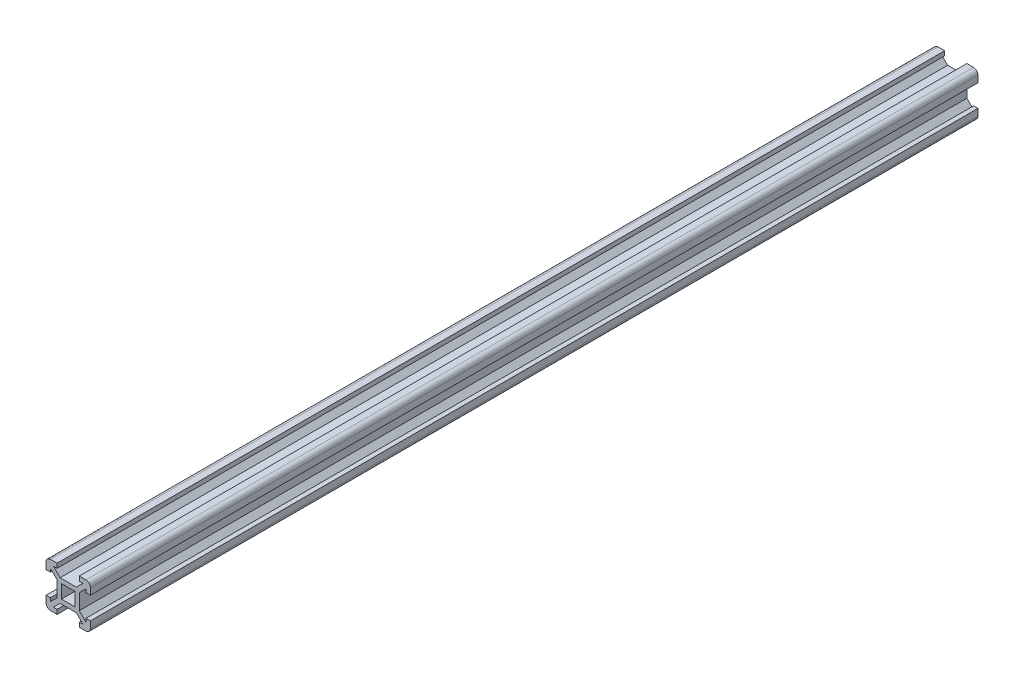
ISO-10303-21;
HEADER;
FILE_DESCRIPTION(('STEP AP214'),'2;1');
FILE_NAME('part.step','',(''),(''),'','','');
FILE_SCHEMA(('AUTOMOTIVE_DESIGN { 1 0 10303 214 1 1 1 1 }'));
ENDSEC;
DATA;
#1=APPLICATION_CONTEXT('core data for automotive mechanical design processes');
#2=APPLICATION_PROTOCOL_DEFINITION('international standard','automotive_design',2000,#1);
#3=PRODUCT_CONTEXT('',#1,'mechanical');
#4=PRODUCT('Part','Part','',(#3));
#5=PRODUCT_RELATED_PRODUCT_CATEGORY('part','',(#4));
#6=PRODUCT_DEFINITION_FORMATION('','',#4);
#7=PRODUCT_DEFINITION_CONTEXT('part definition',#1,'design');
#8=PRODUCT_DEFINITION('design','',#6,#7);
#9=PRODUCT_DEFINITION_SHAPE('','',#8);
#10=(LENGTH_UNIT() NAMED_UNIT(*) SI_UNIT(.MILLI.,.METRE.));
#11=(NAMED_UNIT(*) PLANE_ANGLE_UNIT() SI_UNIT($,.RADIAN.));
#12=(NAMED_UNIT(*) SI_UNIT($,.STERADIAN.) SOLID_ANGLE_UNIT());
#13=UNCERTAINTY_MEASURE_WITH_UNIT(LENGTH_MEASURE(1.E-05),#10,'distance_accuracy_value','');
#14=(GEOMETRIC_REPRESENTATION_CONTEXT(3) GLOBAL_UNCERTAINTY_ASSIGNED_CONTEXT((#13)) GLOBAL_UNIT_ASSIGNED_CONTEXT((#10,
#11,#12)) REPRESENTATION_CONTEXT('',''));
#15=CARTESIAN_POINT('',(0.,0.,0.));
#16=DIRECTION('',(0.,0.,1.));
#17=DIRECTION('',(1.,0.,0.));
#18=AXIS2_PLACEMENT_3D('',#15,#16,#17);
#19=CARTESIAN_POINT('',(2.00000000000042,18.0000000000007,400.));
#20=DIRECTION('',(0.,0.,-1.));
#21=DIRECTION('',(-1.,0.,0.));
#22=AXIS2_PLACEMENT_3D('',#19,#20,#21);
#23=PLANE('',#22);
#24=DIRECTION('',(0.712320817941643,-0.701854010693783,0.));
#25=VECTOR('',#24,1.);
#26=CARTESIAN_POINT('',(5.00000000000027,13.5226684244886,400.));
#27=LINE('',#26,#25);
#28=CARTESIAN_POINT('',(2.00000000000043,16.4785865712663,400.));
#29=VERTEX_POINT('',#28);
#30=CARTESIAN_POINT('',(5.00000000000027,13.5226684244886,400.));
#31=VERTEX_POINT('',#30);
#32=EDGE_CURVE('E348',#29,#31,#27,.T.);
#33=ORIENTED_EDGE('',*,*,#32,.T.);
#34=DIRECTION('',(0.,-1.,0.));
#35=VECTOR('',#34,1.);
#36=CARTESIAN_POINT('',(5.00000000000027,13.5226684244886,400.));
#37=LINE('',#36,#35);
#38=CARTESIAN_POINT('',(5.00000000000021,6.47733157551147,400.));
#39=VERTEX_POINT('',#38);
#40=EDGE_CURVE('E351',#31,#39,#37,.T.);
#41=ORIENTED_EDGE('',*,*,#40,.T.);
#42=DIRECTION('',(-0.712320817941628,-0.701854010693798,0.));
#43=VECTOR('',#42,1.);
#44=CARTESIAN_POINT('',(5.00000000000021,6.47733157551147,400.));
#45=LINE('',#44,#43);
#46=CARTESIAN_POINT('',(2.00000000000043,3.52141342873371,400.));
#47=VERTEX_POINT('',#46);
#48=EDGE_CURVE('E354',#39,#47,#45,.T.);
#49=ORIENTED_EDGE('',*,*,#48,.T.);
#50=DIRECTION('',(0.,1.,0.));
#51=VECTOR('',#50,1.);
#52=CARTESIAN_POINT('',(2.00000000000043,3.52141342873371,400.));
#53=LINE('',#52,#51);
#54=CARTESIAN_POINT('',(2.00000000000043,4.99999999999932,400.));
#55=VERTEX_POINT('',#54);
#56=EDGE_CURVE('E356',#47,#55,#53,.T.);
#57=ORIENTED_EDGE('',*,*,#56,.T.);
#58=DIRECTION('',(-1.,0.,0.));
#59=VECTOR('',#58,1.);
#60=CARTESIAN_POINT('',(4.24509251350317E-13,4.99999999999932,400.));
#61=LINE('',#60,#59);
#62=CARTESIAN_POINT('',(4.24509251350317E-13,4.99999999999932,400.));
#63=VERTEX_POINT('',#62);
#64=EDGE_CURVE('E358',#55,#63,#61,.T.);
#65=ORIENTED_EDGE('',*,*,#64,.T.);
#66=DIRECTION('',(0.,-1.,0.));
#67=VECTOR('',#66,1.);
#68=CARTESIAN_POINT('',(4.24509251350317E-13,4.99999999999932,400.));
#69=LINE('',#68,#67);
#70=CARTESIAN_POINT('',(4.24509251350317E-13,1.99999999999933,400.));
#71=VERTEX_POINT('',#70);
#72=EDGE_CURVE('E360',#63,#71,#69,.T.);
#73=ORIENTED_EDGE('',*,*,#72,.T.);
#74=CARTESIAN_POINT('',(2.00000000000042,1.99999999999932,400.));
#75=DIRECTION('',(0.,0.,1.));
#76=DIRECTION('',(1.,0.,0.));
#77=AXIS2_PLACEMENT_3D('',#74,#75,#76);
#78=CIRCLE('',#77,2.);
#79=CARTESIAN_POINT('',(2.00000000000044,-6.83481049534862E-13,400.));
#80=VERTEX_POINT('',#79);
#81=EDGE_CURVE('E362',#71,#80,#78,.T.);
#82=ORIENTED_EDGE('',*,*,#81,.T.);
#83=DIRECTION('',(1.,0.,0.));
#84=VECTOR('',#83,1.);
#85=CARTESIAN_POINT('',(2.00000000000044,-6.83481049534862E-13,400.));
#86=LINE('',#85,#84);
#87=CARTESIAN_POINT('',(5.,-6.83481049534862E-13,400.));
#88=VERTEX_POINT('',#87);
#89=EDGE_CURVE('E364',#80,#88,#86,.T.);
#90=ORIENTED_EDGE('',*,*,#89,.T.);
#91=DIRECTION('',(0.,1.,0.));
#92=VECTOR('',#91,1.);
#93=CARTESIAN_POINT('',(5.,-6.83481049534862E-13,400.));
#94=LINE('',#93,#92);
#95=CARTESIAN_POINT('',(5.,2.,400.));
#96=VERTEX_POINT('',#95);
#97=EDGE_CURVE('E366',#88,#96,#94,.T.);
#98=ORIENTED_EDGE('',*,*,#97,.T.);
#99=DIRECTION('',(-1.,0.,0.));
#100=VECTOR('',#99,1.);
#101=CARTESIAN_POINT('',(3.30549306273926,1.99999999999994,400.));
#102=LINE('',#101,#100);
#103=CARTESIAN_POINT('',(3.30549306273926,1.99999999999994,400.));
#104=VERTEX_POINT('',#103);
#105=EDGE_CURVE('E368',#96,#104,#102,.T.);
#106=ORIENTED_EDGE('',*,*,#105,.T.);
#107=DIRECTION('',(0.712320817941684,0.701854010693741,0.));
#108=VECTOR('',#107,1.);
#109=CARTESIAN_POINT('',(6.35023231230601,4.99999999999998,400.));
#110=LINE('',#109,#108);
#111=CARTESIAN_POINT('',(6.35023231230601,4.99999999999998,400.));
#112=VERTEX_POINT('',#111);
#113=EDGE_CURVE('E370',#104,#112,#110,.T.);
#114=ORIENTED_EDGE('',*,*,#113,.T.);
#115=DIRECTION('',(1.,0.,0.));
#116=VECTOR('',#115,1.);
#117=CARTESIAN_POINT('',(6.35023231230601,4.99999999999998,400.));
#118=LINE('',#117,#116);
#119=CARTESIAN_POINT('',(13.649767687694,4.99999999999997,400.));
#120=VERTEX_POINT('',#119);
#121=EDGE_CURVE('E372',#112,#120,#118,.T.);
#122=ORIENTED_EDGE('',*,*,#121,.T.);
#123=DIRECTION('',(0.712320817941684,-0.701854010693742,0.));
#124=VECTOR('',#123,1.);
#125=CARTESIAN_POINT('',(13.649767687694,4.99999999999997,400.));
#126=LINE('',#125,#124);
#127=CARTESIAN_POINT('',(16.6945069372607,1.99999999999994,400.));
#128=VERTEX_POINT('',#127);
#129=EDGE_CURVE('E374',#120,#128,#126,.T.);
#130=ORIENTED_EDGE('',*,*,#129,.T.);
#131=DIRECTION('',(-1.,0.,0.));
#132=VECTOR('',#131,1.);
#133=CARTESIAN_POINT('',(16.6945069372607,1.99999999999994,400.));
#134=LINE('',#133,#132);
#135=CARTESIAN_POINT('',(15.,2.,400.));
#136=VERTEX_POINT('',#135);
#137=EDGE_CURVE('E376',#128,#136,#134,.T.);
#138=ORIENTED_EDGE('',*,*,#137,.T.);
#139=DIRECTION('',(0.,-1.,0.));
#140=VECTOR('',#139,1.);
#141=CARTESIAN_POINT('',(15.,-6.83481049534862E-13,400.));
#142=LINE('',#141,#140);
#143=CARTESIAN_POINT('',(15.,-6.83481049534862E-13,400.));
#144=VERTEX_POINT('',#143);
#145=EDGE_CURVE('E378',#136,#144,#142,.T.);
#146=ORIENTED_EDGE('',*,*,#145,.T.);
#147=DIRECTION('',(1.,0.,0.));
#148=VECTOR('',#147,1.);
#149=CARTESIAN_POINT('',(17.9999999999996,-6.85562717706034E-13,400.));
#150=LINE('',#149,#148);
#151=CARTESIAN_POINT('',(17.9999999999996,-6.85562717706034E-13,400.));
#152=VERTEX_POINT('',#151);
#153=EDGE_CURVE('E380',#144,#152,#150,.T.);
#154=ORIENTED_EDGE('',*,*,#153,.T.);
#155=CARTESIAN_POINT('',(17.9999999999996,1.99999999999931,400.));
#156=DIRECTION('',(0.,0.,1.));
#157=DIRECTION('',(1.,0.,0.));
#158=AXIS2_PLACEMENT_3D('',#155,#156,#157);
#159=CIRCLE('',#158,2.);
#160=CARTESIAN_POINT('',(19.9999999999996,1.99999999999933,400.));
#161=VERTEX_POINT('',#160);
#162=EDGE_CURVE('E382',#152,#161,#159,.T.);
#163=ORIENTED_EDGE('',*,*,#162,.T.);
#164=DIRECTION('',(0.,1.,0.));
#165=VECTOR('',#164,1.);
#166=CARTESIAN_POINT('',(19.9999999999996,4.99999999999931,400.));
#167=LINE('',#166,#165);
#168=CARTESIAN_POINT('',(19.9999999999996,4.99999999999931,400.));
#169=VERTEX_POINT('',#168);
#170=EDGE_CURVE('E384',#161,#169,#167,.T.);
#171=ORIENTED_EDGE('',*,*,#170,.T.);
#172=DIRECTION('',(-1.,0.,0.));
#173=VECTOR('',#172,1.);
#174=CARTESIAN_POINT('',(19.9999999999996,4.99999999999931,400.));
#175=LINE('',#174,#173);
#176=CARTESIAN_POINT('',(17.9999999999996,4.99999999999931,400.));
#177=VERTEX_POINT('',#176);
#178=EDGE_CURVE('E386',#169,#177,#175,.T.);
#179=ORIENTED_EDGE('',*,*,#178,.T.);
#180=DIRECTION('',(0.,-1.,0.));
#181=VECTOR('',#180,1.);
#182=CARTESIAN_POINT('',(17.9999999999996,3.52141342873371,400.));
#183=LINE('',#182,#181);
#184=CARTESIAN_POINT('',(17.9999999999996,3.52141342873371,400.));
#185=VERTEX_POINT('',#184);
#186=EDGE_CURVE('E388',#177,#185,#183,.T.);
#187=ORIENTED_EDGE('',*,*,#186,.T.);
#188=DIRECTION('',(-0.712320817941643,0.701854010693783,0.));
#189=VECTOR('',#188,1.);
#190=CARTESIAN_POINT('',(14.9999999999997,6.47733157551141,400.));
#191=LINE('',#190,#189);
#192=CARTESIAN_POINT('',(14.9999999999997,6.47733157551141,400.));
#193=VERTEX_POINT('',#192);
#194=EDGE_CURVE('E390',#185,#193,#191,.T.);
#195=ORIENTED_EDGE('',*,*,#194,.T.);
#196=DIRECTION('',(0.,1.,0.));
#197=VECTOR('',#196,1.);
#198=CARTESIAN_POINT('',(14.9999999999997,13.5226684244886,400.));
#199=LINE('',#198,#197);
#200=CARTESIAN_POINT('',(14.9999999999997,13.5226684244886,400.));
#201=VERTEX_POINT('',#200);
#202=EDGE_CURVE('E392',#193,#201,#199,.T.);
#203=ORIENTED_EDGE('',*,*,#202,.T.);
#204=DIRECTION('',(0.712320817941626,0.7018540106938,0.));
#205=VECTOR('',#204,1.);
#206=CARTESIAN_POINT('',(14.9999999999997,13.5226684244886,400.));
#207=LINE('',#206,#205);
#208=CARTESIAN_POINT('',(17.9999999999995,16.4785865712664,400.));
#209=VERTEX_POINT('',#208);
#210=EDGE_CURVE('E394',#201,#209,#207,.T.);
#211=ORIENTED_EDGE('',*,*,#210,.T.);
#212=DIRECTION('',(0.,-1.,0.));
#213=VECTOR('',#212,1.);
#214=CARTESIAN_POINT('',(17.9999999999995,16.4785865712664,400.));
#215=LINE('',#214,#213);
#216=CARTESIAN_POINT('',(17.9999999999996,15.0000000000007,400.));
#217=VERTEX_POINT('',#216);
#218=EDGE_CURVE('E396',#209,#217,#215,.T.);
#219=ORIENTED_EDGE('',*,*,#218,.T.);
#220=DIRECTION('',(1.,0.,0.));
#221=VECTOR('',#220,1.);
#222=CARTESIAN_POINT('',(19.9999999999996,15.0000000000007,400.));
#223=LINE('',#222,#221);
#224=CARTESIAN_POINT('',(19.9999999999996,15.0000000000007,400.));
#225=VERTEX_POINT('',#224);
#226=EDGE_CURVE('E398',#217,#225,#223,.T.);
#227=ORIENTED_EDGE('',*,*,#226,.T.);
#228=DIRECTION('',(0.,1.,0.));
#229=VECTOR('',#228,1.);
#230=CARTESIAN_POINT('',(19.9999999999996,15.0000000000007,400.));
#231=LINE('',#230,#229);
#232=CARTESIAN_POINT('',(19.9999999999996,18.0000000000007,400.));
#233=VERTEX_POINT('',#232);
#234=EDGE_CURVE('E400',#225,#233,#231,.T.);
#235=ORIENTED_EDGE('',*,*,#234,.T.);
#236=CARTESIAN_POINT('',(17.9999999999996,18.0000000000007,400.));
#237=DIRECTION('',(0.,0.,1.));
#238=DIRECTION('',(1.,0.,0.));
#239=AXIS2_PLACEMENT_3D('',#236,#237,#238);
#240=CIRCLE('',#239,2.);
#241=CARTESIAN_POINT('',(17.9999999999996,20.0000000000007,400.));
#242=VERTEX_POINT('',#241);
#243=EDGE_CURVE('E402',#233,#242,#240,.T.);
#244=ORIENTED_EDGE('',*,*,#243,.T.);
#245=DIRECTION('',(-1.,0.,0.));
#246=VECTOR('',#245,1.);
#247=CARTESIAN_POINT('',(17.9999999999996,20.0000000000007,400.));
#248=LINE('',#247,#246);
#249=CARTESIAN_POINT('',(15.,20.0000000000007,400.));
#250=VERTEX_POINT('',#249);
#251=EDGE_CURVE('E404',#242,#250,#248,.T.);
#252=ORIENTED_EDGE('',*,*,#251,.T.);
#253=DIRECTION('',(0.,-1.,0.));
#254=VECTOR('',#253,1.);
#255=CARTESIAN_POINT('',(15.,20.0000000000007,400.));
#256=LINE('',#255,#254);
#257=CARTESIAN_POINT('',(15.,18.,400.));
#258=VERTEX_POINT('',#257);
#259=EDGE_CURVE('E406',#250,#258,#256,.T.);
#260=ORIENTED_EDGE('',*,*,#259,.T.);
#261=DIRECTION('',(1.,0.,0.));
#262=VECTOR('',#261,1.);
#263=CARTESIAN_POINT('',(16.6945069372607,18.0000000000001,400.));
#264=LINE('',#263,#262);
#265=CARTESIAN_POINT('',(16.6945069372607,18.0000000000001,400.));
#266=VERTEX_POINT('',#265);
#267=EDGE_CURVE('E408',#258,#266,#264,.T.);
#268=ORIENTED_EDGE('',*,*,#267,.T.);
#269=DIRECTION('',(-0.712320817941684,-0.701854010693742,0.));
#270=VECTOR('',#269,1.);
#271=CARTESIAN_POINT('',(13.649767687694,15.,400.));
#272=LINE('',#271,#270);
#273=CARTESIAN_POINT('',(13.649767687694,15.,400.));
#274=VERTEX_POINT('',#273);
#275=EDGE_CURVE('E410',#266,#274,#272,.T.);
#276=ORIENTED_EDGE('',*,*,#275,.T.);
#277=DIRECTION('',(-1.,0.,0.));
#278=VECTOR('',#277,1.);
#279=CARTESIAN_POINT('',(6.35023231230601,15.,400.));
#280=LINE('',#279,#278);
#281=CARTESIAN_POINT('',(6.35023231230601,15.,400.));
#282=VERTEX_POINT('',#281);
#283=EDGE_CURVE('E412',#274,#282,#280,.T.);
#284=ORIENTED_EDGE('',*,*,#283,.T.);
#285=DIRECTION('',(-0.712320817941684,0.701854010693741,0.));
#286=VECTOR('',#285,1.);
#287=CARTESIAN_POINT('',(6.35023231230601,15.,400.));
#288=LINE('',#287,#286);
#289=CARTESIAN_POINT('',(3.30549306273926,18.0000000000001,400.));
#290=VERTEX_POINT('',#289);
#291=EDGE_CURVE('E414',#282,#290,#288,.T.);
#292=ORIENTED_EDGE('',*,*,#291,.T.);
#293=DIRECTION('',(1.,0.,0.));
#294=VECTOR('',#293,1.);
#295=CARTESIAN_POINT('',(3.30549306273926,18.0000000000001,400.));
#296=LINE('',#295,#294);
#297=CARTESIAN_POINT('',(5.,18.,400.));
#298=VERTEX_POINT('',#297);
#299=EDGE_CURVE('E416',#290,#298,#296,.T.);
#300=ORIENTED_EDGE('',*,*,#299,.T.);
#301=DIRECTION('',(0.,1.,0.));
#302=VECTOR('',#301,1.);
#303=CARTESIAN_POINT('',(5.,20.0000000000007,400.));
#304=LINE('',#303,#302);
#305=CARTESIAN_POINT('',(5.,20.0000000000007,400.));
#306=VERTEX_POINT('',#305);
#307=EDGE_CURVE('E418',#298,#306,#304,.T.);
#308=ORIENTED_EDGE('',*,*,#307,.T.);
#309=DIRECTION('',(-1.,0.,0.));
#310=VECTOR('',#309,1.);
#311=CARTESIAN_POINT('',(2.00000000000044,20.0000000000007,400.));
#312=LINE('',#311,#310);
#313=CARTESIAN_POINT('',(2.00000000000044,20.0000000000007,400.));
#314=VERTEX_POINT('',#313);
#315=EDGE_CURVE('E420',#306,#314,#312,.T.);
#316=ORIENTED_EDGE('',*,*,#315,.T.);
#317=CARTESIAN_POINT('',(2.00000000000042,18.0000000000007,400.));
#318=DIRECTION('',(0.,0.,1.));
#319=DIRECTION('',(-1.,0.,0.));
#320=AXIS2_PLACEMENT_3D('',#317,#318,#319);
#321=CIRCLE('',#320,2.);
#322=CARTESIAN_POINT('',(4.25007251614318E-13,18.0000000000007,400.));
#323=VERTEX_POINT('',#322);
#324=EDGE_CURVE('E422',#314,#323,#321,.T.);
#325=ORIENTED_EDGE('',*,*,#324,.T.);
#326=DIRECTION('',(0.,-1.,0.));
#327=VECTOR('',#326,1.);
#328=CARTESIAN_POINT('',(4.24509251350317E-13,15.0000000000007,400.));
#329=LINE('',#328,#327);
#330=CARTESIAN_POINT('',(4.24509251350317E-13,15.0000000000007,400.));
#331=VERTEX_POINT('',#330);
#332=EDGE_CURVE('E424',#323,#331,#329,.T.);
#333=ORIENTED_EDGE('',*,*,#332,.T.);
#334=DIRECTION('',(1.,0.,0.));
#335=VECTOR('',#334,1.);
#336=CARTESIAN_POINT('',(4.24509251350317E-13,15.0000000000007,400.));
#337=LINE('',#336,#335);
#338=CARTESIAN_POINT('',(2.00000000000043,15.0000000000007,400.));
#339=VERTEX_POINT('',#338);
#340=EDGE_CURVE('E426',#331,#339,#337,.T.);
#341=ORIENTED_EDGE('',*,*,#340,.T.);
#342=DIRECTION('',(0.,1.,0.));
#343=VECTOR('',#342,1.);
#344=CARTESIAN_POINT('',(2.00000000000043,16.4785865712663,400.));
#345=LINE('',#344,#343);
#346=EDGE_CURVE('E428',#339,#29,#345,.T.);
#347=ORIENTED_EDGE('',*,*,#346,.T.);
#348=EDGE_LOOP('',(#33,#41,#49,#57,#65,#73,#82,#90,#98,#106,#114,#122,#130,#138,#146,#154,#163,
#171,#179,#187,#195,#203,#211,#219,#227,#235,#244,#252,#260,#268,#276,#284,#292,#300,#308,#316,
#325,#333,#341,#347));
#349=FACE_BOUND('',#348,.T.);
#350=DIRECTION('',(0.,1.,0.));
#351=VECTOR('',#350,1.);
#352=CARTESIAN_POINT('',(13.0427076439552,13.0427076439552,400.));
#353=LINE('',#352,#351);
#354=CARTESIAN_POINT('',(13.0427076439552,6.9572923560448,400.));
#355=VERTEX_POINT('',#354);
#356=CARTESIAN_POINT('',(13.0427076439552,13.0427076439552,400.));
#357=VERTEX_POINT('',#356);
#358=EDGE_CURVE('E312',#355,#357,#353,.T.);
#359=ORIENTED_EDGE('',*,*,#358,.F.);
#360=DIRECTION('',(1.,0.,0.));
#361=VECTOR('',#360,1.);
#362=CARTESIAN_POINT('',(6.95729235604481,6.9572923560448,400.));
#363=LINE('',#362,#361);
#364=CARTESIAN_POINT('',(6.95729235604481,6.9572923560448,400.));
#365=VERTEX_POINT('',#364);
#366=EDGE_CURVE('E334',#365,#355,#363,.T.);
#367=ORIENTED_EDGE('',*,*,#366,.F.);
#368=DIRECTION('',(0.,-1.,0.));
#369=VECTOR('',#368,1.);
#370=CARTESIAN_POINT('',(6.95729235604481,13.0427076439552,400.));
#371=LINE('',#370,#369);
#372=CARTESIAN_POINT('',(6.95729235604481,13.0427076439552,400.));
#373=VERTEX_POINT('',#372);
#374=EDGE_CURVE('E332',#373,#365,#371,.T.);
#375=ORIENTED_EDGE('',*,*,#374,.F.);
#376=DIRECTION('',(-1.,0.,0.));
#377=VECTOR('',#376,1.);
#378=CARTESIAN_POINT('',(6.95729235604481,13.0427076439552,400.));
#379=LINE('',#378,#377);
#380=EDGE_CURVE('E320',#357,#373,#379,.T.);
#381=ORIENTED_EDGE('',*,*,#380,.F.);
#382=EDGE_LOOP('',(#359,#367,#375,#381));
#383=FACE_BOUND('',#382,.T.);
#384=ADVANCED_FACE('F31',(#349,#383),#23,.F.);
#385=CARTESIAN_POINT('',(2.00000000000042,18.0000000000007,0.));
#386=DIRECTION('',(0.,0.,-1.));
#387=DIRECTION('',(-1.,0.,0.));
#388=AXIS2_PLACEMENT_3D('',#385,#386,#387);
#389=PLANE('',#388);
#390=DIRECTION('',(0.712320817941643,-0.701854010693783,0.));
#391=VECTOR('',#390,1.);
#392=CARTESIAN_POINT('',(5.00000000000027,13.5226684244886,0.));
#393=LINE('',#392,#391);
#394=CARTESIAN_POINT('',(2.00000000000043,16.4785865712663,0.));
#395=VERTEX_POINT('',#394);
#396=CARTESIAN_POINT('',(5.00000000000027,13.5226684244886,0.));
#397=VERTEX_POINT('',#396);
#398=EDGE_CURVE('E328',#395,#397,#393,.T.);
#399=ORIENTED_EDGE('',*,*,#398,.F.);
#400=DIRECTION('',(0.,1.,0.));
#401=VECTOR('',#400,1.);
#402=CARTESIAN_POINT('',(2.00000000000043,16.4785865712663,0.));
#403=LINE('',#402,#401);
#404=CARTESIAN_POINT('',(2.00000000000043,15.0000000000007,0.));
#405=VERTEX_POINT('',#404);
#406=EDGE_CURVE('E352',#405,#395,#403,.T.);
#407=ORIENTED_EDGE('',*,*,#406,.F.);
#408=DIRECTION('',(1.,0.,0.));
#409=VECTOR('',#408,1.);
#410=CARTESIAN_POINT('',(4.24509251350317E-13,15.0000000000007,0.));
#411=LINE('',#410,#409);
#412=CARTESIAN_POINT('',(4.24509251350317E-13,15.0000000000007,0.));
#413=VERTEX_POINT('',#412);
#414=EDGE_CURVE('E507',#413,#405,#411,.T.);
#415=ORIENTED_EDGE('',*,*,#414,.F.);
#416=DIRECTION('',(0.,-1.,0.));
#417=VECTOR('',#416,1.);
#418=CARTESIAN_POINT('',(4.24509251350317E-13,15.0000000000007,0.));
#419=LINE('',#418,#417);
#420=CARTESIAN_POINT('',(4.25007251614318E-13,18.0000000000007,0.));
#421=VERTEX_POINT('',#420);
#422=EDGE_CURVE('E505',#421,#413,#419,.T.);
#423=ORIENTED_EDGE('',*,*,#422,.F.);
#424=CARTESIAN_POINT('',(2.00000000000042,18.0000000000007,0.));
#425=DIRECTION('',(0.,0.,1.));
#426=DIRECTION('',(-1.,0.,0.));
#427=AXIS2_PLACEMENT_3D('',#424,#425,#426);
#428=CIRCLE('',#427,2.);
#429=CARTESIAN_POINT('',(2.00000000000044,20.0000000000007,0.));
#430=VERTEX_POINT('',#429);
#431=EDGE_CURVE('E503',#430,#421,#428,.T.);
#432=ORIENTED_EDGE('',*,*,#431,.F.);
#433=DIRECTION('',(-1.,0.,0.));
#434=VECTOR('',#433,1.);
#435=CARTESIAN_POINT('',(2.00000000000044,20.0000000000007,0.));
#436=LINE('',#435,#434);
#437=CARTESIAN_POINT('',(5.,20.0000000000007,0.));
#438=VERTEX_POINT('',#437);
#439=EDGE_CURVE('E501',#438,#430,#436,.T.);
#440=ORIENTED_EDGE('',*,*,#439,.F.);
#441=DIRECTION('',(0.,1.,0.));
#442=VECTOR('',#441,1.);
#443=CARTESIAN_POINT('',(5.,20.0000000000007,0.));
#444=LINE('',#443,#442);
#445=CARTESIAN_POINT('',(5.,18.,0.));
#446=VERTEX_POINT('',#445);
#447=EDGE_CURVE('E499',#446,#438,#444,.T.);
#448=ORIENTED_EDGE('',*,*,#447,.F.);
#449=DIRECTION('',(1.,0.,0.));
#450=VECTOR('',#449,1.);
#451=CARTESIAN_POINT('',(3.30549306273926,18.0000000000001,0.));
#452=LINE('',#451,#450);
#453=CARTESIAN_POINT('',(3.30549306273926,18.0000000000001,0.));
#454=VERTEX_POINT('',#453);
#455=EDGE_CURVE('E497',#454,#446,#452,.T.);
#456=ORIENTED_EDGE('',*,*,#455,.F.);
#457=DIRECTION('',(-0.712320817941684,0.701854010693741,0.));
#458=VECTOR('',#457,1.);
#459=CARTESIAN_POINT('',(6.35023231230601,15.,0.));
#460=LINE('',#459,#458);
#461=CARTESIAN_POINT('',(6.35023231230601,15.,0.));
#462=VERTEX_POINT('',#461);
#463=EDGE_CURVE('E495',#462,#454,#460,.T.);
#464=ORIENTED_EDGE('',*,*,#463,.F.);
#465=DIRECTION('',(-1.,0.,0.));
#466=VECTOR('',#465,1.);
#467=CARTESIAN_POINT('',(6.35023231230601,15.,0.));
#468=LINE('',#467,#466);
#469=CARTESIAN_POINT('',(13.649767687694,15.,0.));
#470=VERTEX_POINT('',#469);
#471=EDGE_CURVE('E493',#470,#462,#468,.T.);
#472=ORIENTED_EDGE('',*,*,#471,.F.);
#473=DIRECTION('',(-0.712320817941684,-0.701854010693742,0.));
#474=VECTOR('',#473,1.);
#475=CARTESIAN_POINT('',(13.649767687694,15.,0.));
#476=LINE('',#475,#474);
#477=CARTESIAN_POINT('',(16.6945069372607,18.0000000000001,0.));
#478=VERTEX_POINT('',#477);
#479=EDGE_CURVE('E491',#478,#470,#476,.T.);
#480=ORIENTED_EDGE('',*,*,#479,.F.);
#481=DIRECTION('',(1.,0.,0.));
#482=VECTOR('',#481,1.);
#483=CARTESIAN_POINT('',(16.6945069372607,18.0000000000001,0.));
#484=LINE('',#483,#482);
#485=CARTESIAN_POINT('',(15.,18.,0.));
#486=VERTEX_POINT('',#485);
#487=EDGE_CURVE('E489',#486,#478,#484,.T.);
#488=ORIENTED_EDGE('',*,*,#487,.F.);
#489=DIRECTION('',(0.,-1.,0.));
#490=VECTOR('',#489,1.);
#491=CARTESIAN_POINT('',(15.,20.0000000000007,0.));
#492=LINE('',#491,#490);
#493=CARTESIAN_POINT('',(15.,20.0000000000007,0.));
#494=VERTEX_POINT('',#493);
#495=EDGE_CURVE('E487',#494,#486,#492,.T.);
#496=ORIENTED_EDGE('',*,*,#495,.F.);
#497=DIRECTION('',(-1.,0.,0.));
#498=VECTOR('',#497,1.);
#499=CARTESIAN_POINT('',(17.9999999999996,20.0000000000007,0.));
#500=LINE('',#499,#498);
#501=CARTESIAN_POINT('',(17.9999999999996,20.0000000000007,0.));
#502=VERTEX_POINT('',#501);
#503=EDGE_CURVE('E485',#502,#494,#500,.T.);
#504=ORIENTED_EDGE('',*,*,#503,.F.);
#505=CARTESIAN_POINT('',(17.9999999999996,18.0000000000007,0.));
#506=DIRECTION('',(0.,0.,1.));
#507=DIRECTION('',(1.,0.,0.));
#508=AXIS2_PLACEMENT_3D('',#505,#506,#507);
#509=CIRCLE('',#508,2.);
#510=CARTESIAN_POINT('',(19.9999999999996,18.0000000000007,0.));
#511=VERTEX_POINT('',#510);
#512=EDGE_CURVE('E483',#511,#502,#509,.T.);
#513=ORIENTED_EDGE('',*,*,#512,.F.);
#514=DIRECTION('',(0.,1.,0.));
#515=VECTOR('',#514,1.);
#516=CARTESIAN_POINT('',(19.9999999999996,15.0000000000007,0.));
#517=LINE('',#516,#515);
#518=CARTESIAN_POINT('',(19.9999999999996,15.0000000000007,0.));
#519=VERTEX_POINT('',#518);
#520=EDGE_CURVE('E481',#519,#511,#517,.T.);
#521=ORIENTED_EDGE('',*,*,#520,.F.);
#522=DIRECTION('',(1.,0.,0.));
#523=VECTOR('',#522,1.);
#524=CARTESIAN_POINT('',(19.9999999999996,15.0000000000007,0.));
#525=LINE('',#524,#523);
#526=CARTESIAN_POINT('',(17.9999999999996,15.0000000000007,0.));
#527=VERTEX_POINT('',#526);
#528=EDGE_CURVE('E479',#527,#519,#525,.T.);
#529=ORIENTED_EDGE('',*,*,#528,.F.);
#530=DIRECTION('',(0.,-1.,0.));
#531=VECTOR('',#530,1.);
#532=CARTESIAN_POINT('',(17.9999999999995,16.4785865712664,0.));
#533=LINE('',#532,#531);
#534=CARTESIAN_POINT('',(17.9999999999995,16.4785865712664,0.));
#535=VERTEX_POINT('',#534);
#536=EDGE_CURVE('E477',#535,#527,#533,.T.);
#537=ORIENTED_EDGE('',*,*,#536,.F.);
#538=DIRECTION('',(0.712320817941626,0.7018540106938,0.));
#539=VECTOR('',#538,1.);
#540=CARTESIAN_POINT('',(14.9999999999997,13.5226684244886,0.));
#541=LINE('',#540,#539);
#542=CARTESIAN_POINT('',(14.9999999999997,13.5226684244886,0.));
#543=VERTEX_POINT('',#542);
#544=EDGE_CURVE('E475',#543,#535,#541,.T.);
#545=ORIENTED_EDGE('',*,*,#544,.F.);
#546=DIRECTION('',(0.,1.,0.));
#547=VECTOR('',#546,1.);
#548=CARTESIAN_POINT('',(14.9999999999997,13.5226684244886,0.));
#549=LINE('',#548,#547);
#550=CARTESIAN_POINT('',(14.9999999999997,6.47733157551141,0.));
#551=VERTEX_POINT('',#550);
#552=EDGE_CURVE('E473',#551,#543,#549,.T.);
#553=ORIENTED_EDGE('',*,*,#552,.F.);
#554=DIRECTION('',(-0.712320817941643,0.701854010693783,0.));
#555=VECTOR('',#554,1.);
#556=CARTESIAN_POINT('',(14.9999999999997,6.47733157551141,0.));
#557=LINE('',#556,#555);
#558=CARTESIAN_POINT('',(17.9999999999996,3.52141342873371,0.));
#559=VERTEX_POINT('',#558);
#560=EDGE_CURVE('E471',#559,#551,#557,.T.);
#561=ORIENTED_EDGE('',*,*,#560,.F.);
#562=DIRECTION('',(0.,-1.,0.));
#563=VECTOR('',#562,1.);
#564=CARTESIAN_POINT('',(17.9999999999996,3.52141342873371,0.));
#565=LINE('',#564,#563);
#566=CARTESIAN_POINT('',(17.9999999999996,4.99999999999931,0.));
#567=VERTEX_POINT('',#566);
#568=EDGE_CURVE('E469',#567,#559,#565,.T.);
#569=ORIENTED_EDGE('',*,*,#568,.F.);
#570=DIRECTION('',(-1.,0.,0.));
#571=VECTOR('',#570,1.);
#572=CARTESIAN_POINT('',(19.9999999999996,4.99999999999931,0.));
#573=LINE('',#572,#571);
#574=CARTESIAN_POINT('',(19.9999999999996,4.99999999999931,0.));
#575=VERTEX_POINT('',#574);
#576=EDGE_CURVE('E467',#575,#567,#573,.T.);
#577=ORIENTED_EDGE('',*,*,#576,.F.);
#578=DIRECTION('',(0.,1.,0.));
#579=VECTOR('',#578,1.);
#580=CARTESIAN_POINT('',(19.9999999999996,4.99999999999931,0.));
#581=LINE('',#580,#579);
#582=CARTESIAN_POINT('',(19.9999999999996,1.99999999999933,0.));
#583=VERTEX_POINT('',#582);
#584=EDGE_CURVE('E465',#583,#575,#581,.T.);
#585=ORIENTED_EDGE('',*,*,#584,.F.);
#586=CARTESIAN_POINT('',(17.9999999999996,1.99999999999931,0.));
#587=DIRECTION('',(0.,0.,1.));
#588=DIRECTION('',(1.,0.,0.));
#589=AXIS2_PLACEMENT_3D('',#586,#587,#588);
#590=CIRCLE('',#589,2.);
#591=CARTESIAN_POINT('',(17.9999999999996,-6.85562717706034E-13,0.));
#592=VERTEX_POINT('',#591);
#593=EDGE_CURVE('E463',#592,#583,#590,.T.);
#594=ORIENTED_EDGE('',*,*,#593,.F.);
#595=DIRECTION('',(1.,0.,0.));
#596=VECTOR('',#595,1.);
#597=CARTESIAN_POINT('',(17.9999999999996,-6.85562717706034E-13,0.));
#598=LINE('',#597,#596);
#599=CARTESIAN_POINT('',(15.,-6.83481049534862E-13,0.));
#600=VERTEX_POINT('',#599);
#601=EDGE_CURVE('E461',#600,#592,#598,.T.);
#602=ORIENTED_EDGE('',*,*,#601,.F.);
#603=DIRECTION('',(0.,-1.,0.));
#604=VECTOR('',#603,1.);
#605=CARTESIAN_POINT('',(15.,-6.83481049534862E-13,0.));
#606=LINE('',#605,#604);
#607=CARTESIAN_POINT('',(15.,2.,0.));
#608=VERTEX_POINT('',#607);
#609=EDGE_CURVE('E459',#608,#600,#606,.T.);
#610=ORIENTED_EDGE('',*,*,#609,.F.);
#611=DIRECTION('',(-1.,0.,0.));
#612=VECTOR('',#611,1.);
#613=CARTESIAN_POINT('',(16.6945069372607,1.99999999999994,0.));
#614=LINE('',#613,#612);
#615=CARTESIAN_POINT('',(16.6945069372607,1.99999999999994,0.));
#616=VERTEX_POINT('',#615);
#617=EDGE_CURVE('E457',#616,#608,#614,.T.);
#618=ORIENTED_EDGE('',*,*,#617,.F.);
#619=DIRECTION('',(0.712320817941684,-0.701854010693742,0.));
#620=VECTOR('',#619,1.);
#621=CARTESIAN_POINT('',(13.649767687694,4.99999999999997,0.));
#622=LINE('',#621,#620);
#623=CARTESIAN_POINT('',(13.649767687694,4.99999999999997,0.));
#624=VERTEX_POINT('',#623);
#625=EDGE_CURVE('E455',#624,#616,#622,.T.);
#626=ORIENTED_EDGE('',*,*,#625,.F.);
#627=DIRECTION('',(1.,0.,0.));
#628=VECTOR('',#627,1.);
#629=CARTESIAN_POINT('',(6.35023231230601,4.99999999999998,0.));
#630=LINE('',#629,#628);
#631=CARTESIAN_POINT('',(6.35023231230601,4.99999999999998,0.));
#632=VERTEX_POINT('',#631);
#633=EDGE_CURVE('E453',#632,#624,#630,.T.);
#634=ORIENTED_EDGE('',*,*,#633,.F.);
#635=DIRECTION('',(0.712320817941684,0.701854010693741,0.));
#636=VECTOR('',#635,1.);
#637=CARTESIAN_POINT('',(6.35023231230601,4.99999999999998,0.));
#638=LINE('',#637,#636);
#639=CARTESIAN_POINT('',(3.30549306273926,1.99999999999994,0.));
#640=VERTEX_POINT('',#639);
#641=EDGE_CURVE('E451',#640,#632,#638,.T.);
#642=ORIENTED_EDGE('',*,*,#641,.F.);
#643=DIRECTION('',(-1.,0.,0.));
#644=VECTOR('',#643,1.);
#645=CARTESIAN_POINT('',(3.30549306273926,1.99999999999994,0.));
#646=LINE('',#645,#644);
#647=CARTESIAN_POINT('',(5.,2.,0.));
#648=VERTEX_POINT('',#647);
#649=EDGE_CURVE('E449',#648,#640,#646,.T.);
#650=ORIENTED_EDGE('',*,*,#649,.F.);
#651=DIRECTION('',(0.,1.,0.));
#652=VECTOR('',#651,1.);
#653=CARTESIAN_POINT('',(5.,-6.83481049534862E-13,0.));
#654=LINE('',#653,#652);
#655=CARTESIAN_POINT('',(5.,-6.83481049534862E-13,0.));
#656=VERTEX_POINT('',#655);
#657=EDGE_CURVE('E447',#656,#648,#654,.T.);
#658=ORIENTED_EDGE('',*,*,#657,.F.);
#659=DIRECTION('',(1.,0.,0.));
#660=VECTOR('',#659,1.);
#661=CARTESIAN_POINT('',(2.00000000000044,-6.83481049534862E-13,0.));
#662=LINE('',#661,#660);
#663=CARTESIAN_POINT('',(2.00000000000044,-6.83481049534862E-13,0.));
#664=VERTEX_POINT('',#663);
#665=EDGE_CURVE('E445',#664,#656,#662,.T.);
#666=ORIENTED_EDGE('',*,*,#665,.F.);
#667=CARTESIAN_POINT('',(2.00000000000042,1.99999999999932,0.));
#668=DIRECTION('',(0.,0.,1.));
#669=DIRECTION('',(1.,0.,0.));
#670=AXIS2_PLACEMENT_3D('',#667,#668,#669);
#671=CIRCLE('',#670,2.);
#672=CARTESIAN_POINT('',(4.24509251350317E-13,1.99999999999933,0.));
#673=VERTEX_POINT('',#672);
#674=EDGE_CURVE('E443',#673,#664,#671,.T.);
#675=ORIENTED_EDGE('',*,*,#674,.F.);
#676=DIRECTION('',(0.,-1.,0.));
#677=VECTOR('',#676,1.);
#678=CARTESIAN_POINT('',(4.24509251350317E-13,4.99999999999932,0.));
#679=LINE('',#678,#677);
#680=CARTESIAN_POINT('',(4.24509251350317E-13,4.99999999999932,0.));
#681=VERTEX_POINT('',#680);
#682=EDGE_CURVE('E441',#681,#673,#679,.T.);
#683=ORIENTED_EDGE('',*,*,#682,.F.);
#684=DIRECTION('',(-1.,0.,0.));
#685=VECTOR('',#684,1.);
#686=CARTESIAN_POINT('',(4.24509251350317E-13,4.99999999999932,0.));
#687=LINE('',#686,#685);
#688=CARTESIAN_POINT('',(2.00000000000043,4.99999999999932,0.));
#689=VERTEX_POINT('',#688);
#690=EDGE_CURVE('E439',#689,#681,#687,.T.);
#691=ORIENTED_EDGE('',*,*,#690,.F.);
#692=DIRECTION('',(0.,1.,0.));
#693=VECTOR('',#692,1.);
#694=CARTESIAN_POINT('',(2.00000000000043,3.52141342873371,0.));
#695=LINE('',#694,#693);
#696=CARTESIAN_POINT('',(2.00000000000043,3.52141342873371,0.));
#697=VERTEX_POINT('',#696);
#698=EDGE_CURVE('E437',#697,#689,#695,.T.);
#699=ORIENTED_EDGE('',*,*,#698,.F.);
#700=DIRECTION('',(-0.712320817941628,-0.701854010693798,0.));
#701=VECTOR('',#700,1.);
#702=CARTESIAN_POINT('',(5.00000000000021,6.47733157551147,0.));
#703=LINE('',#702,#701);
#704=CARTESIAN_POINT('',(5.00000000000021,6.47733157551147,0.));
#705=VERTEX_POINT('',#704);
#706=EDGE_CURVE('E435',#705,#697,#703,.T.);
#707=ORIENTED_EDGE('',*,*,#706,.F.);
#708=DIRECTION('',(0.,-1.,0.));
#709=VECTOR('',#708,1.);
#710=CARTESIAN_POINT('',(5.00000000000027,13.5226684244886,0.));
#711=LINE('',#710,#709);
#712=EDGE_CURVE('E433',#397,#705,#711,.T.);
#713=ORIENTED_EDGE('',*,*,#712,.F.);
#714=EDGE_LOOP('',(#399,#407,#415,#423,#432,#440,#448,#456,#464,#472,#480,#488,#496,#504,#513,
#521,#529,#537,#545,#553,#561,#569,#577,#585,#594,#602,#610,#618,#626,#634,#642,#650,#658,#666,
#675,#683,#691,#699,#707,#713));
#715=FACE_BOUND('',#714,.T.);
#716=DIRECTION('',(1.,0.,0.));
#717=VECTOR('',#716,1.);
#718=CARTESIAN_POINT('',(6.95729235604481,6.9572923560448,0.));
#719=LINE('',#718,#717);
#720=CARTESIAN_POINT('',(6.95729235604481,6.9572923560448,0.));
#721=VERTEX_POINT('',#720);
#722=CARTESIAN_POINT('',(13.0427076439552,6.9572923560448,0.));
#723=VERTEX_POINT('',#722);
#724=EDGE_CURVE('E321',#721,#723,#719,.T.);
#725=ORIENTED_EDGE('',*,*,#724,.T.);
#726=DIRECTION('',(0.,1.,0.));
#727=VECTOR('',#726,1.);
#728=CARTESIAN_POINT('',(13.0427076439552,13.0427076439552,0.));
#729=LINE('',#728,#727);
#730=CARTESIAN_POINT('',(13.0427076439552,13.0427076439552,0.));
#731=VERTEX_POINT('',#730);
#732=EDGE_CURVE('E54',#723,#731,#729,.T.);
#733=ORIENTED_EDGE('',*,*,#732,.T.);
#734=DIRECTION('',(-1.,0.,0.));
#735=VECTOR('',#734,1.);
#736=CARTESIAN_POINT('',(6.95729235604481,13.0427076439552,0.));
#737=LINE('',#736,#735);
#738=CARTESIAN_POINT('',(6.95729235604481,13.0427076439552,0.));
#739=VERTEX_POINT('',#738);
#740=EDGE_CURVE('E327',#731,#739,#737,.T.);
#741=ORIENTED_EDGE('',*,*,#740,.T.);
#742=DIRECTION('',(0.,-1.,0.));
#743=VECTOR('',#742,1.);
#744=CARTESIAN_POINT('',(6.95729235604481,13.0427076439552,0.));
#745=LINE('',#744,#743);
#746=EDGE_CURVE('E340',#739,#721,#745,.T.);
#747=ORIENTED_EDGE('',*,*,#746,.T.);
#748=EDGE_LOOP('',(#725,#733,#741,#747));
#749=FACE_BOUND('',#748,.T.);
#750=ADVANCED_FACE('F633',(#715,#749),#389,.T.);
#751=CARTESIAN_POINT('',(5.00000000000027,13.5226684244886,400.));
#752=DIRECTION('',(0.701854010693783,0.712320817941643,0.));
#753=DIRECTION('',(-0.712320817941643,0.701854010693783,0.));
#754=AXIS2_PLACEMENT_3D('',#751,#752,#753);
#755=PLANE('',#754);
#756=ORIENTED_EDGE('',*,*,#398,.T.);
#757=DIRECTION('',(0.,0.,-1.));
#758=VECTOR('',#757,1.);
#759=CARTESIAN_POINT('',(5.00000000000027,13.5226684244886,400.));
#760=LINE('',#759,#758);
#761=EDGE_CURVE('E11',#31,#397,#760,.T.);
#762=ORIENTED_EDGE('',*,*,#761,.F.);
#763=ORIENTED_EDGE('',*,*,#32,.F.);
#764=DIRECTION('',(0.,0.,-1.));
#765=VECTOR('',#764,1.);
#766=CARTESIAN_POINT('',(2.00000000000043,16.4785865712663,400.));
#767=LINE('',#766,#765);
#768=EDGE_CURVE('E430',#29,#395,#767,.T.);
#769=ORIENTED_EDGE('',*,*,#768,.T.);
#770=EDGE_LOOP('',(#756,#762,#763,#769));
#771=FACE_BOUND('',#770,.T.);
#772=ADVANCED_FACE('F33',(#771),#755,.F.);
#773=CARTESIAN_POINT('',(5.00000000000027,13.5226684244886,400.));
#774=DIRECTION('',(1.,0.,0.));
#775=DIRECTION('',(0.,1.,0.));
#776=AXIS2_PLACEMENT_3D('',#773,#774,#775);
#777=PLANE('',#776);
#778=ORIENTED_EDGE('',*,*,#712,.T.);
#779=DIRECTION('',(0.,0.,-1.));
#780=VECTOR('',#779,1.);
#781=CARTESIAN_POINT('',(5.00000000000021,6.47733157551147,400.));
#782=LINE('',#781,#780);
#783=EDGE_CURVE('E39',#39,#705,#782,.T.);
#784=ORIENTED_EDGE('',*,*,#783,.F.);
#785=ORIENTED_EDGE('',*,*,#40,.F.);
#786=ORIENTED_EDGE('',*,*,#761,.T.);
#787=EDGE_LOOP('',(#778,#784,#785,#786));
#788=FACE_BOUND('',#787,.T.);
#789=ADVANCED_FACE('F650',(#788),#777,.F.);
#790=CARTESIAN_POINT('',(5.00000000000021,6.47733157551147,400.));
#791=DIRECTION('',(0.701854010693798,-0.712320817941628,0.));
#792=DIRECTION('',(0.712320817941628,0.701854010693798,0.));
#793=AXIS2_PLACEMENT_3D('',#790,#791,#792);
#794=PLANE('',#793);
#795=ORIENTED_EDGE('',*,*,#706,.T.);
#796=DIRECTION('',(0.,0.,-1.));
#797=VECTOR('',#796,1.);
#798=CARTESIAN_POINT('',(2.00000000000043,3.52141342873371,400.));
#799=LINE('',#798,#797);
#800=EDGE_CURVE('E620',#47,#697,#799,.T.);
#801=ORIENTED_EDGE('',*,*,#800,.F.);
#802=ORIENTED_EDGE('',*,*,#48,.F.);
#803=ORIENTED_EDGE('',*,*,#783,.T.);
#804=EDGE_LOOP('',(#795,#801,#802,#803));
#805=FACE_BOUND('',#804,.T.);
#806=ADVANCED_FACE('F627',(#805),#794,.F.);
#807=CARTESIAN_POINT('',(2.00000000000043,3.52141342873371,400.));
#808=DIRECTION('',(-1.,0.,0.));
#809=DIRECTION('',(0.,0.,1.));
#810=AXIS2_PLACEMENT_3D('',#807,#808,#809);
#811=PLANE('',#810);
#812=ORIENTED_EDGE('',*,*,#698,.T.);
#813=DIRECTION('',(0.,0.,-1.));
#814=VECTOR('',#813,1.);
#815=CARTESIAN_POINT('',(2.00000000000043,4.99999999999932,400.));
#816=LINE('',#815,#814);
#817=EDGE_CURVE('E617',#55,#689,#816,.T.);
#818=ORIENTED_EDGE('',*,*,#817,.F.);
#819=ORIENTED_EDGE('',*,*,#56,.F.);
#820=ORIENTED_EDGE('',*,*,#800,.T.);
#821=EDGE_LOOP('',(#812,#818,#819,#820));
#822=FACE_BOUND('',#821,.T.);
#823=ADVANCED_FACE('F639',(#822),#811,.F.);
#824=CARTESIAN_POINT('',(4.24509251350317E-13,4.99999999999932,400.));
#825=DIRECTION('',(0.,-1.,0.));
#826=DIRECTION('',(0.,0.,-1.));
#827=AXIS2_PLACEMENT_3D('',#824,#825,#826);
#828=PLANE('',#827);
#829=ORIENTED_EDGE('',*,*,#690,.T.);
#830=DIRECTION('',(0.,0.,-1.));
#831=VECTOR('',#830,1.);
#832=CARTESIAN_POINT('',(4.24509251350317E-13,4.99999999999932,400.));
#833=LINE('',#832,#831);
#834=EDGE_CURVE('E614',#63,#681,#833,.T.);
#835=ORIENTED_EDGE('',*,*,#834,.F.);
#836=ORIENTED_EDGE('',*,*,#64,.F.);
#837=ORIENTED_EDGE('',*,*,#817,.T.);
#838=EDGE_LOOP('',(#829,#835,#836,#837));
#839=FACE_BOUND('',#838,.T.);
#840=ADVANCED_FACE('F643',(#839),#828,.F.);
#841=CARTESIAN_POINT('',(4.24509251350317E-13,4.99999999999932,400.));
#842=DIRECTION('',(1.,0.,0.));
#843=DIRECTION('',(0.,0.,-1.));
#844=AXIS2_PLACEMENT_3D('',#841,#842,#843);
#845=PLANE('',#844);
#846=ORIENTED_EDGE('',*,*,#682,.T.);
#847=DIRECTION('',(0.,0.,-1.));
#848=VECTOR('',#847,1.);
#849=CARTESIAN_POINT('',(4.24509251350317E-13,1.99999999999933,400.));
#850=LINE('',#849,#848);
#851=EDGE_CURVE('E611',#71,#673,#850,.T.);
#852=ORIENTED_EDGE('',*,*,#851,.F.);
#853=ORIENTED_EDGE('',*,*,#72,.F.);
#854=ORIENTED_EDGE('',*,*,#834,.T.);
#855=EDGE_LOOP('',(#846,#852,#853,#854));
#856=FACE_BOUND('',#855,.T.);
#857=ADVANCED_FACE('F823',(#856),#845,.F.);
#858=CARTESIAN_POINT('',(2.00000000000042,1.99999999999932,400.));
#859=DIRECTION('',(0.,0.,-1.));
#860=DIRECTION('',(-1.,0.,0.));
#861=AXIS2_PLACEMENT_3D('',#858,#859,#860);
#862=CYLINDRICAL_SURFACE('',#861,2.);
#863=ORIENTED_EDGE('',*,*,#674,.T.);
#864=DIRECTION('',(0.,0.,-1.));
#865=VECTOR('',#864,1.);
#866=CARTESIAN_POINT('',(2.00000000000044,-6.83481049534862E-13,400.));
#867=LINE('',#866,#865);
#868=EDGE_CURVE('E608',#80,#664,#867,.T.);
#869=ORIENTED_EDGE('',*,*,#868,.F.);
#870=ORIENTED_EDGE('',*,*,#81,.F.);
#871=ORIENTED_EDGE('',*,*,#851,.T.);
#872=EDGE_LOOP('',(#863,#869,#870,#871));
#873=FACE_BOUND('',#872,.T.);
#874=ADVANCED_FACE('F820',(#873),#862,.T.);
#875=CARTESIAN_POINT('',(2.00000000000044,-6.83481049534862E-13,400.));
#876=DIRECTION('',(0.,1.,0.));
#877=DIRECTION('',(0.,0.,1.));
#878=AXIS2_PLACEMENT_3D('',#875,#876,#877);
#879=PLANE('',#878);
#880=ORIENTED_EDGE('',*,*,#665,.T.);
#881=DIRECTION('',(0.,0.,-1.));
#882=VECTOR('',#881,1.);
#883=CARTESIAN_POINT('',(5.,-6.83481049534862E-13,400.));
#884=LINE('',#883,#882);
#885=EDGE_CURVE('E605',#88,#656,#884,.T.);
#886=ORIENTED_EDGE('',*,*,#885,.F.);
#887=ORIENTED_EDGE('',*,*,#89,.F.);
#888=ORIENTED_EDGE('',*,*,#868,.T.);
#889=EDGE_LOOP('',(#880,#886,#887,#888));
#890=FACE_BOUND('',#889,.T.);
#891=ADVANCED_FACE('F816',(#890),#879,.F.);
#892=CARTESIAN_POINT('',(5.,-6.83481049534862E-13,400.));
#893=DIRECTION('',(-1.,0.,0.));
#894=DIRECTION('',(0.,0.,1.));
#895=AXIS2_PLACEMENT_3D('',#892,#893,#894);
#896=PLANE('',#895);
#897=ORIENTED_EDGE('',*,*,#657,.T.);
#898=DIRECTION('',(0.,0.,-1.));
#899=VECTOR('',#898,1.);
#900=CARTESIAN_POINT('',(5.,2.,400.));
#901=LINE('',#900,#899);
#902=EDGE_CURVE('E602',#96,#648,#901,.T.);
#903=ORIENTED_EDGE('',*,*,#902,.F.);
#904=ORIENTED_EDGE('',*,*,#97,.F.);
#905=ORIENTED_EDGE('',*,*,#885,.T.);
#906=EDGE_LOOP('',(#897,#903,#904,#905));
#907=FACE_BOUND('',#906,.T.);
#908=ADVANCED_FACE('F812',(#907),#896,.F.);
#909=CARTESIAN_POINT('',(3.30549306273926,1.99999999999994,400.));
#910=DIRECTION('',(0.,-1.,0.));
#911=DIRECTION('',(1.,0.,0.));
#912=AXIS2_PLACEMENT_3D('',#909,#910,#911);
#913=PLANE('',#912);
#914=ORIENTED_EDGE('',*,*,#649,.T.);
#915=DIRECTION('',(0.,0.,-1.));
#916=VECTOR('',#915,1.);
#917=CARTESIAN_POINT('',(3.30549306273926,1.99999999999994,400.));
#918=LINE('',#917,#916);
#919=EDGE_CURVE('E599',#104,#640,#918,.T.);
#920=ORIENTED_EDGE('',*,*,#919,.F.);
#921=ORIENTED_EDGE('',*,*,#105,.F.);
#922=ORIENTED_EDGE('',*,*,#902,.T.);
#923=EDGE_LOOP('',(#914,#920,#921,#922));
#924=FACE_BOUND('',#923,.T.);
#925=ADVANCED_FACE('F807',(#924),#913,.F.);
#926=CARTESIAN_POINT('',(6.35023231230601,4.99999999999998,400.));
#927=DIRECTION('',(-0.701854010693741,0.712320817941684,0.));
#928=DIRECTION('',(-0.712320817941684,-0.701854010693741,0.));
#929=AXIS2_PLACEMENT_3D('',#926,#927,#928);
#930=PLANE('',#929);
#931=ORIENTED_EDGE('',*,*,#641,.T.);
#932=DIRECTION('',(0.,0.,-1.));
#933=VECTOR('',#932,1.);
#934=CARTESIAN_POINT('',(6.35023231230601,4.99999999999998,400.));
#935=LINE('',#934,#933);
#936=EDGE_CURVE('E596',#112,#632,#935,.T.);
#937=ORIENTED_EDGE('',*,*,#936,.F.);
#938=ORIENTED_EDGE('',*,*,#113,.F.);
#939=ORIENTED_EDGE('',*,*,#919,.T.);
#940=EDGE_LOOP('',(#931,#937,#938,#939));
#941=FACE_BOUND('',#940,.T.);
#942=ADVANCED_FACE('F801',(#941),#930,.F.);
#943=CARTESIAN_POINT('',(6.35023231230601,4.99999999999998,400.));
#944=DIRECTION('',(0.,1.,0.));
#945=DIRECTION('',(-1.,0.,0.));
#946=AXIS2_PLACEMENT_3D('',#943,#944,#945);
#947=PLANE('',#946);
#948=ORIENTED_EDGE('',*,*,#633,.T.);
#949=DIRECTION('',(0.,0.,-1.));
#950=VECTOR('',#949,1.);
#951=CARTESIAN_POINT('',(13.649767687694,4.99999999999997,400.));
#952=LINE('',#951,#950);
#953=EDGE_CURVE('E593',#120,#624,#952,.T.);
#954=ORIENTED_EDGE('',*,*,#953,.F.);
#955=ORIENTED_EDGE('',*,*,#121,.F.);
#956=ORIENTED_EDGE('',*,*,#936,.T.);
#957=EDGE_LOOP('',(#948,#954,#955,#956));
#958=FACE_BOUND('',#957,.T.);
#959=ADVANCED_FACE('F797',(#958),#947,.F.);
#960=CARTESIAN_POINT('',(13.649767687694,4.99999999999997,400.));
#961=DIRECTION('',(0.701854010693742,0.712320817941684,0.));
#962=DIRECTION('',(-0.712320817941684,0.701854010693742,0.));
#963=AXIS2_PLACEMENT_3D('',#960,#961,#962);
#964=PLANE('',#963);
#965=ORIENTED_EDGE('',*,*,#625,.T.);
#966=DIRECTION('',(0.,0.,-1.));
#967=VECTOR('',#966,1.);
#968=CARTESIAN_POINT('',(16.6945069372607,1.99999999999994,400.));
#969=LINE('',#968,#967);
#970=EDGE_CURVE('E590',#128,#616,#969,.T.);
#971=ORIENTED_EDGE('',*,*,#970,.F.);
#972=ORIENTED_EDGE('',*,*,#129,.F.);
#973=ORIENTED_EDGE('',*,*,#953,.T.);
#974=EDGE_LOOP('',(#965,#971,#972,#973));
#975=FACE_BOUND('',#974,.T.);
#976=ADVANCED_FACE('F792',(#975),#964,.F.);
#977=CARTESIAN_POINT('',(16.6945069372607,1.99999999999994,400.));
#978=DIRECTION('',(0.,-1.,0.));
#979=DIRECTION('',(1.,0.,0.));
#980=AXIS2_PLACEMENT_3D('',#977,#978,#979);
#981=PLANE('',#980);
#982=ORIENTED_EDGE('',*,*,#617,.T.);
#983=DIRECTION('',(0.,0.,-1.));
#984=VECTOR('',#983,1.);
#985=CARTESIAN_POINT('',(15.,2.,400.));
#986=LINE('',#985,#984);
#987=EDGE_CURVE('E587',#136,#608,#986,.T.);
#988=ORIENTED_EDGE('',*,*,#987,.F.);
#989=ORIENTED_EDGE('',*,*,#137,.F.);
#990=ORIENTED_EDGE('',*,*,#970,.T.);
#991=EDGE_LOOP('',(#982,#988,#989,#990));
#992=FACE_BOUND('',#991,.T.);
#993=ADVANCED_FACE('F786',(#992),#981,.F.);
#994=CARTESIAN_POINT('',(15.,-6.83481049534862E-13,400.));
#995=DIRECTION('',(1.,0.,0.));
#996=DIRECTION('',(0.,1.,0.));
#997=AXIS2_PLACEMENT_3D('',#994,#995,#996);
#998=PLANE('',#997);
#999=ORIENTED_EDGE('',*,*,#609,.T.);
#1000=DIRECTION('',(0.,0.,-1.));
#1001=VECTOR('',#1000,1.);
#1002=CARTESIAN_POINT('',(15.,-6.83481049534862E-13,400.));
#1003=LINE('',#1002,#1001);
#1004=EDGE_CURVE('E584',#144,#600,#1003,.T.);
#1005=ORIENTED_EDGE('',*,*,#1004,.F.);
#1006=ORIENTED_EDGE('',*,*,#145,.F.);
#1007=ORIENTED_EDGE('',*,*,#987,.T.);
#1008=EDGE_LOOP('',(#999,#1005,#1006,#1007));
#1009=FACE_BOUND('',#1008,.T.);
#1010=ADVANCED_FACE('F782',(#1009),#998,.F.);
#1011=CARTESIAN_POINT('',(17.9999999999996,-6.85562717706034E-13,400.));
#1012=DIRECTION('',(0.,1.,0.));
#1013=DIRECTION('',(-1.,0.,0.));
#1014=AXIS2_PLACEMENT_3D('',#1011,#1012,#1013);
#1015=PLANE('',#1014);
#1016=ORIENTED_EDGE('',*,*,#601,.T.);
#1017=DIRECTION('',(0.,0.,-1.));
#1018=VECTOR('',#1017,1.);
#1019=CARTESIAN_POINT('',(17.9999999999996,-6.85562717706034E-13,400.));
#1020=LINE('',#1019,#1018);
#1021=EDGE_CURVE('E581',#152,#592,#1020,.T.);
#1022=ORIENTED_EDGE('',*,*,#1021,.F.);
#1023=ORIENTED_EDGE('',*,*,#153,.F.);
#1024=ORIENTED_EDGE('',*,*,#1004,.T.);
#1025=EDGE_LOOP('',(#1016,#1022,#1023,#1024));
#1026=FACE_BOUND('',#1025,.T.);
#1027=ADVANCED_FACE('F777',(#1026),#1015,.F.);
#1028=CARTESIAN_POINT('',(17.9999999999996,1.99999999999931,400.));
#1029=DIRECTION('',(0.,0.,-1.));
#1030=DIRECTION('',(-1.,0.,0.));
#1031=AXIS2_PLACEMENT_3D('',#1028,#1029,#1030);
#1032=CYLINDRICAL_SURFACE('',#1031,2.);
#1033=ORIENTED_EDGE('',*,*,#593,.T.);
#1034=DIRECTION('',(0.,0.,-1.));
#1035=VECTOR('',#1034,1.);
#1036=CARTESIAN_POINT('',(19.9999999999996,1.99999999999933,400.));
#1037=LINE('',#1036,#1035);
#1038=EDGE_CURVE('E578',#161,#583,#1037,.T.);
#1039=ORIENTED_EDGE('',*,*,#1038,.F.);
#1040=ORIENTED_EDGE('',*,*,#162,.F.);
#1041=ORIENTED_EDGE('',*,*,#1021,.T.);
#1042=EDGE_LOOP('',(#1033,#1039,#1040,#1041));
#1043=FACE_BOUND('',#1042,.T.);
#1044=ADVANCED_FACE('F771',(#1043),#1032,.T.);
#1045=CARTESIAN_POINT('',(19.9999999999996,4.99999999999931,400.));
#1046=DIRECTION('',(-1.,0.,0.));
#1047=DIRECTION('',(0.,0.,1.));
#1048=AXIS2_PLACEMENT_3D('',#1045,#1046,#1047);
#1049=PLANE('',#1048);
#1050=ORIENTED_EDGE('',*,*,#584,.T.);
#1051=DIRECTION('',(0.,0.,-1.));
#1052=VECTOR('',#1051,1.);
#1053=CARTESIAN_POINT('',(19.9999999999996,4.99999999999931,400.));
#1054=LINE('',#1053,#1052);
#1055=EDGE_CURVE('E575',#169,#575,#1054,.T.);
#1056=ORIENTED_EDGE('',*,*,#1055,.F.);
#1057=ORIENTED_EDGE('',*,*,#170,.F.);
#1058=ORIENTED_EDGE('',*,*,#1038,.T.);
#1059=EDGE_LOOP('',(#1050,#1056,#1057,#1058));
#1060=FACE_BOUND('',#1059,.T.);
#1061=ADVANCED_FACE('F767',(#1060),#1049,.F.);
#1062=CARTESIAN_POINT('',(19.9999999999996,4.99999999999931,400.));
#1063=DIRECTION('',(0.,-1.,0.));
#1064=DIRECTION('',(0.,0.,-1.));
#1065=AXIS2_PLACEMENT_3D('',#1062,#1063,#1064);
#1066=PLANE('',#1065);
#1067=ORIENTED_EDGE('',*,*,#576,.T.);
#1068=DIRECTION('',(0.,0.,-1.));
#1069=VECTOR('',#1068,1.);
#1070=CARTESIAN_POINT('',(17.9999999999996,4.99999999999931,400.));
#1071=LINE('',#1070,#1069);
#1072=EDGE_CURVE('E572',#177,#567,#1071,.T.);
#1073=ORIENTED_EDGE('',*,*,#1072,.F.);
#1074=ORIENTED_EDGE('',*,*,#178,.F.);
#1075=ORIENTED_EDGE('',*,*,#1055,.T.);
#1076=EDGE_LOOP('',(#1067,#1073,#1074,#1075));
#1077=FACE_BOUND('',#1076,.T.);
#1078=ADVANCED_FACE('F762',(#1077),#1066,.F.);
#1079=CARTESIAN_POINT('',(17.9999999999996,3.52141342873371,400.));
#1080=DIRECTION('',(1.,0.,0.));
#1081=DIRECTION('',(0.,0.,-1.));
#1082=AXIS2_PLACEMENT_3D('',#1079,#1080,#1081);
#1083=PLANE('',#1082);
#1084=ORIENTED_EDGE('',*,*,#568,.T.);
#1085=DIRECTION('',(0.,0.,-1.));
#1086=VECTOR('',#1085,1.);
#1087=CARTESIAN_POINT('',(17.9999999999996,3.52141342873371,400.));
#1088=LINE('',#1087,#1086);
#1089=EDGE_CURVE('E569',#185,#559,#1088,.T.);
#1090=ORIENTED_EDGE('',*,*,#1089,.F.);
#1091=ORIENTED_EDGE('',*,*,#186,.F.);
#1092=ORIENTED_EDGE('',*,*,#1072,.T.);
#1093=EDGE_LOOP('',(#1084,#1090,#1091,#1092));
#1094=FACE_BOUND('',#1093,.T.);
#1095=ADVANCED_FACE('F756',(#1094),#1083,.F.);
#1096=CARTESIAN_POINT('',(14.9999999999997,6.47733157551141,400.));
#1097=DIRECTION('',(-0.701854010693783,-0.712320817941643,0.));
#1098=DIRECTION('',(0.712320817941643,-0.701854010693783,0.));
#1099=AXIS2_PLACEMENT_3D('',#1096,#1097,#1098);
#1100=PLANE('',#1099);
#1101=ORIENTED_EDGE('',*,*,#560,.T.);
#1102=DIRECTION('',(0.,0.,-1.));
#1103=VECTOR('',#1102,1.);
#1104=CARTESIAN_POINT('',(14.9999999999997,6.47733157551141,400.));
#1105=LINE('',#1104,#1103);
#1106=EDGE_CURVE('E566',#193,#551,#1105,.T.);
#1107=ORIENTED_EDGE('',*,*,#1106,.F.);
#1108=ORIENTED_EDGE('',*,*,#194,.F.);
#1109=ORIENTED_EDGE('',*,*,#1089,.T.);
#1110=EDGE_LOOP('',(#1101,#1107,#1108,#1109));
#1111=FACE_BOUND('',#1110,.T.);
#1112=ADVANCED_FACE('F752',(#1111),#1100,.F.);
#1113=CARTESIAN_POINT('',(14.9999999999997,13.5226684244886,400.));
#1114=DIRECTION('',(-1.,0.,0.));
#1115=DIRECTION('',(0.,-1.,0.));
#1116=AXIS2_PLACEMENT_3D('',#1113,#1114,#1115);
#1117=PLANE('',#1116);
#1118=ORIENTED_EDGE('',*,*,#552,.T.);
#1119=DIRECTION('',(0.,0.,-1.));
#1120=VECTOR('',#1119,1.);
#1121=CARTESIAN_POINT('',(14.9999999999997,13.5226684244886,400.));
#1122=LINE('',#1121,#1120);
#1123=EDGE_CURVE('E563',#201,#543,#1122,.T.);
#1124=ORIENTED_EDGE('',*,*,#1123,.F.);
#1125=ORIENTED_EDGE('',*,*,#202,.F.);
#1126=ORIENTED_EDGE('',*,*,#1106,.T.);
#1127=EDGE_LOOP('',(#1118,#1124,#1125,#1126));
#1128=FACE_BOUND('',#1127,.T.);
#1129=ADVANCED_FACE('F747',(#1128),#1117,.F.);
#1130=CARTESIAN_POINT('',(14.9999999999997,13.5226684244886,400.));
#1131=DIRECTION('',(-0.7018540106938,0.712320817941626,0.));
#1132=DIRECTION('',(-0.712320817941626,-0.7018540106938,0.));
#1133=AXIS2_PLACEMENT_3D('',#1130,#1131,#1132);
#1134=PLANE('',#1133);
#1135=ORIENTED_EDGE('',*,*,#544,.T.);
#1136=DIRECTION('',(0.,0.,-1.));
#1137=VECTOR('',#1136,1.);
#1138=CARTESIAN_POINT('',(17.9999999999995,16.4785865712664,400.));
#1139=LINE('',#1138,#1137);
#1140=EDGE_CURVE('E560',#209,#535,#1139,.T.);
#1141=ORIENTED_EDGE('',*,*,#1140,.F.);
#1142=ORIENTED_EDGE('',*,*,#210,.F.);
#1143=ORIENTED_EDGE('',*,*,#1123,.T.);
#1144=EDGE_LOOP('',(#1135,#1141,#1142,#1143));
#1145=FACE_BOUND('',#1144,.T.);
#1146=ADVANCED_FACE('F741',(#1145),#1134,.F.);
#1147=CARTESIAN_POINT('',(17.9999999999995,16.4785865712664,400.));
#1148=DIRECTION('',(1.,0.,0.));
#1149=DIRECTION('',(0.,1.,0.));
#1150=AXIS2_PLACEMENT_3D('',#1147,#1148,#1149);
#1151=PLANE('',#1150);
#1152=ORIENTED_EDGE('',*,*,#536,.T.);
#1153=DIRECTION('',(0.,0.,-1.));
#1154=VECTOR('',#1153,1.);
#1155=CARTESIAN_POINT('',(17.9999999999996,15.0000000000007,400.));
#1156=LINE('',#1155,#1154);
#1157=EDGE_CURVE('E557',#217,#527,#1156,.T.);
#1158=ORIENTED_EDGE('',*,*,#1157,.F.);
#1159=ORIENTED_EDGE('',*,*,#218,.F.);
#1160=ORIENTED_EDGE('',*,*,#1140,.T.);
#1161=EDGE_LOOP('',(#1152,#1158,#1159,#1160));
#1162=FACE_BOUND('',#1161,.T.);
#1163=ADVANCED_FACE('F737',(#1162),#1151,.F.);
#1164=CARTESIAN_POINT('',(19.9999999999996,15.0000000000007,400.));
#1165=DIRECTION('',(0.,1.,0.));
#1166=DIRECTION('',(0.,0.,1.));
#1167=AXIS2_PLACEMENT_3D('',#1164,#1165,#1166);
#1168=PLANE('',#1167);
#1169=ORIENTED_EDGE('',*,*,#528,.T.);
#1170=DIRECTION('',(0.,0.,-1.));
#1171=VECTOR('',#1170,1.);
#1172=CARTESIAN_POINT('',(19.9999999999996,15.0000000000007,400.));
#1173=LINE('',#1172,#1171);
#1174=EDGE_CURVE('E554',#225,#519,#1173,.T.);
#1175=ORIENTED_EDGE('',*,*,#1174,.F.);
#1176=ORIENTED_EDGE('',*,*,#226,.F.);
#1177=ORIENTED_EDGE('',*,*,#1157,.T.);
#1178=EDGE_LOOP('',(#1169,#1175,#1176,#1177));
#1179=FACE_BOUND('',#1178,.T.);
#1180=ADVANCED_FACE('F732',(#1179),#1168,.F.);
#1181=CARTESIAN_POINT('',(19.9999999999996,15.0000000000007,400.));
#1182=DIRECTION('',(-1.,0.,0.));
#1183=DIRECTION('',(0.,0.,1.));
#1184=AXIS2_PLACEMENT_3D('',#1181,#1182,#1183);
#1185=PLANE('',#1184);
#1186=ORIENTED_EDGE('',*,*,#520,.T.);
#1187=DIRECTION('',(0.,0.,-1.));
#1188=VECTOR('',#1187,1.);
#1189=CARTESIAN_POINT('',(19.9999999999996,18.0000000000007,400.));
#1190=LINE('',#1189,#1188);
#1191=EDGE_CURVE('E551',#233,#511,#1190,.T.);
#1192=ORIENTED_EDGE('',*,*,#1191,.F.);
#1193=ORIENTED_EDGE('',*,*,#234,.F.);
#1194=ORIENTED_EDGE('',*,*,#1174,.T.);
#1195=EDGE_LOOP('',(#1186,#1192,#1193,#1194));
#1196=FACE_BOUND('',#1195,.T.);
#1197=ADVANCED_FACE('F726',(#1196),#1185,.F.);
#1198=CARTESIAN_POINT('',(17.9999999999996,18.0000000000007,400.));
#1199=DIRECTION('',(0.,0.,-1.));
#1200=DIRECTION('',(-1.,0.,0.));
#1201=AXIS2_PLACEMENT_3D('',#1198,#1199,#1200);
#1202=CYLINDRICAL_SURFACE('',#1201,2.);
#1203=ORIENTED_EDGE('',*,*,#512,.T.);
#1204=DIRECTION('',(0.,0.,-1.));
#1205=VECTOR('',#1204,1.);
#1206=CARTESIAN_POINT('',(17.9999999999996,20.0000000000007,400.));
#1207=LINE('',#1206,#1205);
#1208=EDGE_CURVE('E548',#242,#502,#1207,.T.);
#1209=ORIENTED_EDGE('',*,*,#1208,.F.);
#1210=ORIENTED_EDGE('',*,*,#243,.F.);
#1211=ORIENTED_EDGE('',*,*,#1191,.T.);
#1212=EDGE_LOOP('',(#1203,#1209,#1210,#1211));
#1213=FACE_BOUND('',#1212,.T.);
#1214=ADVANCED_FACE('F722',(#1213),#1202,.T.);
#1215=CARTESIAN_POINT('',(17.9999999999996,20.0000000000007,400.));
#1216=DIRECTION('',(0.,-1.,0.));
#1217=DIRECTION('',(1.,0.,0.));
#1218=AXIS2_PLACEMENT_3D('',#1215,#1216,#1217);
#1219=PLANE('',#1218);
#1220=ORIENTED_EDGE('',*,*,#503,.T.);
#1221=DIRECTION('',(0.,0.,-1.));
#1222=VECTOR('',#1221,1.);
#1223=CARTESIAN_POINT('',(15.,20.0000000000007,400.));
#1224=LINE('',#1223,#1222);
#1225=EDGE_CURVE('E545',#250,#494,#1224,.T.);
#1226=ORIENTED_EDGE('',*,*,#1225,.F.);
#1227=ORIENTED_EDGE('',*,*,#251,.F.);
#1228=ORIENTED_EDGE('',*,*,#1208,.T.);
#1229=EDGE_LOOP('',(#1220,#1226,#1227,#1228));
#1230=FACE_BOUND('',#1229,.T.);
#1231=ADVANCED_FACE('F717',(#1230),#1219,.F.);
#1232=CARTESIAN_POINT('',(15.,20.0000000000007,400.));
#1233=DIRECTION('',(1.,0.,0.));
#1234=DIRECTION('',(0.,1.,0.));
#1235=AXIS2_PLACEMENT_3D('',#1232,#1233,#1234);
#1236=PLANE('',#1235);
#1237=ORIENTED_EDGE('',*,*,#495,.T.);
#1238=DIRECTION('',(0.,0.,-1.));
#1239=VECTOR('',#1238,1.);
#1240=CARTESIAN_POINT('',(15.,18.,400.));
#1241=LINE('',#1240,#1239);
#1242=EDGE_CURVE('E542',#258,#486,#1241,.T.);
#1243=ORIENTED_EDGE('',*,*,#1242,.F.);
#1244=ORIENTED_EDGE('',*,*,#259,.F.);
#1245=ORIENTED_EDGE('',*,*,#1225,.T.);
#1246=EDGE_LOOP('',(#1237,#1243,#1244,#1245));
#1247=FACE_BOUND('',#1246,.T.);
#1248=ADVANCED_FACE('F711',(#1247),#1236,.F.);
#1249=CARTESIAN_POINT('',(16.6945069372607,18.0000000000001,400.));
#1250=DIRECTION('',(0.,1.,0.));
#1251=DIRECTION('',(-1.,0.,0.));
#1252=AXIS2_PLACEMENT_3D('',#1249,#1250,#1251);
#1253=PLANE('',#1252);
#1254=ORIENTED_EDGE('',*,*,#487,.T.);
#1255=DIRECTION('',(0.,0.,-1.));
#1256=VECTOR('',#1255,1.);
#1257=CARTESIAN_POINT('',(16.6945069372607,18.0000000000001,400.));
#1258=LINE('',#1257,#1256);
#1259=EDGE_CURVE('E539',#266,#478,#1258,.T.);
#1260=ORIENTED_EDGE('',*,*,#1259,.F.);
#1261=ORIENTED_EDGE('',*,*,#267,.F.);
#1262=ORIENTED_EDGE('',*,*,#1242,.T.);
#1263=EDGE_LOOP('',(#1254,#1260,#1261,#1262));
#1264=FACE_BOUND('',#1263,.T.);
#1265=ADVANCED_FACE('F707',(#1264),#1253,.F.);
#1266=CARTESIAN_POINT('',(13.649767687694,15.,400.));
#1267=DIRECTION('',(0.701854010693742,-0.712320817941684,0.));
#1268=DIRECTION('',(0.712320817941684,0.701854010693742,0.));
#1269=AXIS2_PLACEMENT_3D('',#1266,#1267,#1268);
#1270=PLANE('',#1269);
#1271=ORIENTED_EDGE('',*,*,#479,.T.);
#1272=DIRECTION('',(0.,0.,-1.));
#1273=VECTOR('',#1272,1.);
#1274=CARTESIAN_POINT('',(13.649767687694,15.,400.));
#1275=LINE('',#1274,#1273);
#1276=EDGE_CURVE('E536',#274,#470,#1275,.T.);
#1277=ORIENTED_EDGE('',*,*,#1276,.F.);
#1278=ORIENTED_EDGE('',*,*,#275,.F.);
#1279=ORIENTED_EDGE('',*,*,#1259,.T.);
#1280=EDGE_LOOP('',(#1271,#1277,#1278,#1279));
#1281=FACE_BOUND('',#1280,.T.);
#1282=ADVANCED_FACE('F702',(#1281),#1270,.F.);
#1283=CARTESIAN_POINT('',(6.35023231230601,15.,400.));
#1284=DIRECTION('',(0.,-1.,0.));
#1285=DIRECTION('',(1.,0.,0.));
#1286=AXIS2_PLACEMENT_3D('',#1283,#1284,#1285);
#1287=PLANE('',#1286);
#1288=ORIENTED_EDGE('',*,*,#471,.T.);
#1289=DIRECTION('',(0.,0.,-1.));
#1290=VECTOR('',#1289,1.);
#1291=CARTESIAN_POINT('',(6.35023231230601,15.,400.));
#1292=LINE('',#1291,#1290);
#1293=EDGE_CURVE('E533',#282,#462,#1292,.T.);
#1294=ORIENTED_EDGE('',*,*,#1293,.F.);
#1295=ORIENTED_EDGE('',*,*,#283,.F.);
#1296=ORIENTED_EDGE('',*,*,#1276,.T.);
#1297=EDGE_LOOP('',(#1288,#1294,#1295,#1296));
#1298=FACE_BOUND('',#1297,.T.);
#1299=ADVANCED_FACE('F696',(#1298),#1287,.F.);
#1300=CARTESIAN_POINT('',(6.35023231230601,15.,400.));
#1301=DIRECTION('',(-0.701854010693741,-0.712320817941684,0.));
#1302=DIRECTION('',(0.712320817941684,-0.701854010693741,0.));
#1303=AXIS2_PLACEMENT_3D('',#1300,#1301,#1302);
#1304=PLANE('',#1303);
#1305=ORIENTED_EDGE('',*,*,#463,.T.);
#1306=DIRECTION('',(0.,0.,-1.));
#1307=VECTOR('',#1306,1.);
#1308=CARTESIAN_POINT('',(3.30549306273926,18.0000000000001,400.));
#1309=LINE('',#1308,#1307);
#1310=EDGE_CURVE('E530',#290,#454,#1309,.T.);
#1311=ORIENTED_EDGE('',*,*,#1310,.F.);
#1312=ORIENTED_EDGE('',*,*,#291,.F.);
#1313=ORIENTED_EDGE('',*,*,#1293,.T.);
#1314=EDGE_LOOP('',(#1305,#1311,#1312,#1313));
#1315=FACE_BOUND('',#1314,.T.);
#1316=ADVANCED_FACE('F692',(#1315),#1304,.F.);
#1317=CARTESIAN_POINT('',(3.30549306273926,18.0000000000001,400.));
#1318=DIRECTION('',(0.,1.,0.));
#1319=DIRECTION('',(-1.,0.,0.));
#1320=AXIS2_PLACEMENT_3D('',#1317,#1318,#1319);
#1321=PLANE('',#1320);
#1322=ORIENTED_EDGE('',*,*,#455,.T.);
#1323=DIRECTION('',(0.,0.,-1.));
#1324=VECTOR('',#1323,1.);
#1325=CARTESIAN_POINT('',(5.,18.,400.));
#1326=LINE('',#1325,#1324);
#1327=EDGE_CURVE('E527',#298,#446,#1326,.T.);
#1328=ORIENTED_EDGE('',*,*,#1327,.F.);
#1329=ORIENTED_EDGE('',*,*,#299,.F.);
#1330=ORIENTED_EDGE('',*,*,#1310,.T.);
#1331=EDGE_LOOP('',(#1322,#1328,#1329,#1330));
#1332=FACE_BOUND('',#1331,.T.);
#1333=ADVANCED_FACE('F687',(#1332),#1321,.F.);
#1334=CARTESIAN_POINT('',(5.,20.0000000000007,400.));
#1335=DIRECTION('',(-1.,0.,0.));
#1336=DIRECTION('',(0.,0.,1.));
#1337=AXIS2_PLACEMENT_3D('',#1334,#1335,#1336);
#1338=PLANE('',#1337);
#1339=ORIENTED_EDGE('',*,*,#447,.T.);
#1340=DIRECTION('',(0.,0.,-1.));
#1341=VECTOR('',#1340,1.);
#1342=CARTESIAN_POINT('',(5.,20.0000000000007,400.));
#1343=LINE('',#1342,#1341);
#1344=EDGE_CURVE('E524',#306,#438,#1343,.T.);
#1345=ORIENTED_EDGE('',*,*,#1344,.F.);
#1346=ORIENTED_EDGE('',*,*,#307,.F.);
#1347=ORIENTED_EDGE('',*,*,#1327,.T.);
#1348=EDGE_LOOP('',(#1339,#1345,#1346,#1347));
#1349=FACE_BOUND('',#1348,.T.);
#1350=ADVANCED_FACE('F681',(#1349),#1338,.F.);
#1351=CARTESIAN_POINT('',(2.00000000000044,20.0000000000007,400.));
#1352=DIRECTION('',(0.,-1.,0.));
#1353=DIRECTION('',(0.,0.,-1.));
#1354=AXIS2_PLACEMENT_3D('',#1351,#1352,#1353);
#1355=PLANE('',#1354);
#1356=ORIENTED_EDGE('',*,*,#439,.T.);
#1357=DIRECTION('',(0.,0.,-1.));
#1358=VECTOR('',#1357,1.);
#1359=CARTESIAN_POINT('',(2.00000000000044,20.0000000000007,400.));
#1360=LINE('',#1359,#1358);
#1361=EDGE_CURVE('E521',#314,#430,#1360,.T.);
#1362=ORIENTED_EDGE('',*,*,#1361,.F.);
#1363=ORIENTED_EDGE('',*,*,#315,.F.);
#1364=ORIENTED_EDGE('',*,*,#1344,.T.);
#1365=EDGE_LOOP('',(#1356,#1362,#1363,#1364));
#1366=FACE_BOUND('',#1365,.T.);
#1367=ADVANCED_FACE('F677',(#1366),#1355,.F.);
#1368=CARTESIAN_POINT('',(2.00000000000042,18.0000000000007,400.));
#1369=DIRECTION('',(0.,0.,-1.));
#1370=DIRECTION('',(-1.,0.,0.));
#1371=AXIS2_PLACEMENT_3D('',#1368,#1369,#1370);
#1372=CYLINDRICAL_SURFACE('',#1371,2.);
#1373=ORIENTED_EDGE('',*,*,#431,.T.);
#1374=DIRECTION('',(0.,0.,-1.));
#1375=VECTOR('',#1374,1.);
#1376=CARTESIAN_POINT('',(4.25007251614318E-13,18.0000000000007,400.));
#1377=LINE('',#1376,#1375);
#1378=EDGE_CURVE('E518',#323,#421,#1377,.T.);
#1379=ORIENTED_EDGE('',*,*,#1378,.F.);
#1380=ORIENTED_EDGE('',*,*,#324,.F.);
#1381=ORIENTED_EDGE('',*,*,#1361,.T.);
#1382=EDGE_LOOP('',(#1373,#1379,#1380,#1381));
#1383=FACE_BOUND('',#1382,.T.);
#1384=ADVANCED_FACE('F672',(#1383),#1372,.T.);
#1385=CARTESIAN_POINT('',(4.24509251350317E-13,15.0000000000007,400.));
#1386=DIRECTION('',(1.,0.,0.));
#1387=DIRECTION('',(0.,0.,-1.));
#1388=AXIS2_PLACEMENT_3D('',#1385,#1386,#1387);
#1389=PLANE('',#1388);
#1390=ORIENTED_EDGE('',*,*,#422,.T.);
#1391=DIRECTION('',(0.,0.,-1.));
#1392=VECTOR('',#1391,1.);
#1393=CARTESIAN_POINT('',(4.24509251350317E-13,15.0000000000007,400.));
#1394=LINE('',#1393,#1392);
#1395=EDGE_CURVE('E515',#331,#413,#1394,.T.);
#1396=ORIENTED_EDGE('',*,*,#1395,.F.);
#1397=ORIENTED_EDGE('',*,*,#332,.F.);
#1398=ORIENTED_EDGE('',*,*,#1378,.T.);
#1399=EDGE_LOOP('',(#1390,#1396,#1397,#1398));
#1400=FACE_BOUND('',#1399,.T.);
#1401=ADVANCED_FACE('F666',(#1400),#1389,.F.);
#1402=CARTESIAN_POINT('',(4.24509251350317E-13,15.0000000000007,400.));
#1403=DIRECTION('',(0.,1.,0.));
#1404=DIRECTION('',(0.,0.,1.));
#1405=AXIS2_PLACEMENT_3D('',#1402,#1403,#1404);
#1406=PLANE('',#1405);
#1407=ORIENTED_EDGE('',*,*,#414,.T.);
#1408=DIRECTION('',(0.,0.,-1.));
#1409=VECTOR('',#1408,1.);
#1410=CARTESIAN_POINT('',(2.00000000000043,15.0000000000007,400.));
#1411=LINE('',#1410,#1409);
#1412=EDGE_CURVE('E512',#339,#405,#1411,.T.);
#1413=ORIENTED_EDGE('',*,*,#1412,.F.);
#1414=ORIENTED_EDGE('',*,*,#340,.F.);
#1415=ORIENTED_EDGE('',*,*,#1395,.T.);
#1416=EDGE_LOOP('',(#1407,#1413,#1414,#1415));
#1417=FACE_BOUND('',#1416,.T.);
#1418=ADVANCED_FACE('F662',(#1417),#1406,.F.);
#1419=CARTESIAN_POINT('',(2.00000000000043,16.4785865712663,400.));
#1420=DIRECTION('',(-1.,0.,0.));
#1421=DIRECTION('',(0.,0.,1.));
#1422=AXIS2_PLACEMENT_3D('',#1419,#1420,#1421);
#1423=PLANE('',#1422);
#1424=ORIENTED_EDGE('',*,*,#406,.T.);
#1425=ORIENTED_EDGE('',*,*,#768,.F.);
#1426=ORIENTED_EDGE('',*,*,#346,.F.);
#1427=ORIENTED_EDGE('',*,*,#1412,.T.);
#1428=EDGE_LOOP('',(#1424,#1425,#1426,#1427));
#1429=FACE_BOUND('',#1428,.T.);
#1430=ADVANCED_FACE('F657',(#1429),#1423,.F.);
#1431=CARTESIAN_POINT('',(13.0427076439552,13.0427076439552,400.));
#1432=DIRECTION('',(-1.,0.,0.));
#1433=DIRECTION('',(0.,0.,1.));
#1434=AXIS2_PLACEMENT_3D('',#1431,#1432,#1433);
#1435=PLANE('',#1434);
#1436=ORIENTED_EDGE('',*,*,#732,.F.);
#1437=DIRECTION('',(0.,0.,-1.));
#1438=VECTOR('',#1437,1.);
#1439=CARTESIAN_POINT('',(13.0427076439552,6.9572923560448,400.));
#1440=LINE('',#1439,#1438);
#1441=EDGE_CURVE('E316',#355,#723,#1440,.T.);
#1442=ORIENTED_EDGE('',*,*,#1441,.F.);
#1443=ORIENTED_EDGE('',*,*,#358,.T.);
#1444=DIRECTION('',(0.,0.,-1.));
#1445=VECTOR('',#1444,1.);
#1446=CARTESIAN_POINT('',(13.0427076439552,13.0427076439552,400.));
#1447=LINE('',#1446,#1445);
#1448=EDGE_CURVE('E315',#357,#731,#1447,.T.);
#1449=ORIENTED_EDGE('',*,*,#1448,.T.);
#1450=EDGE_LOOP('',(#1436,#1442,#1443,#1449));
#1451=FACE_BOUND('',#1450,.T.);
#1452=ADVANCED_FACE('F314',(#1451),#1435,.T.);
#1453=CARTESIAN_POINT('',(6.95729235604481,13.0427076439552,400.));
#1454=DIRECTION('',(0.,-1.,0.));
#1455=DIRECTION('',(0.,0.,-1.));
#1456=AXIS2_PLACEMENT_3D('',#1453,#1454,#1455);
#1457=PLANE('',#1456);
#1458=ORIENTED_EDGE('',*,*,#740,.F.);
#1459=ORIENTED_EDGE('',*,*,#1448,.F.);
#1460=ORIENTED_EDGE('',*,*,#380,.T.);
#1461=DIRECTION('',(0.,0.,-1.));
#1462=VECTOR('',#1461,1.);
#1463=CARTESIAN_POINT('',(6.95729235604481,13.0427076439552,400.));
#1464=LINE('',#1463,#1462);
#1465=EDGE_CURVE('E329',#373,#739,#1464,.T.);
#1466=ORIENTED_EDGE('',*,*,#1465,.T.);
#1467=EDGE_LOOP('',(#1458,#1459,#1460,#1466));
#1468=FACE_BOUND('',#1467,.T.);
#1469=ADVANCED_FACE('F324',(#1468),#1457,.T.);
#1470=CARTESIAN_POINT('',(6.95729235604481,13.0427076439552,400.));
#1471=DIRECTION('',(1.,0.,0.));
#1472=DIRECTION('',(0.,0.,-1.));
#1473=AXIS2_PLACEMENT_3D('',#1470,#1471,#1472);
#1474=PLANE('',#1473);
#1475=ORIENTED_EDGE('',*,*,#746,.F.);
#1476=ORIENTED_EDGE('',*,*,#1465,.F.);
#1477=ORIENTED_EDGE('',*,*,#374,.T.);
#1478=DIRECTION('',(0.,0.,-1.));
#1479=VECTOR('',#1478,1.);
#1480=CARTESIAN_POINT('',(6.95729235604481,6.9572923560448,400.));
#1481=LINE('',#1480,#1479);
#1482=EDGE_CURVE('E46',#365,#721,#1481,.T.);
#1483=ORIENTED_EDGE('',*,*,#1482,.T.);
#1484=EDGE_LOOP('',(#1475,#1476,#1477,#1483));
#1485=FACE_BOUND('',#1484,.T.);
#1486=ADVANCED_FACE('F1049',(#1485),#1474,.T.);
#1487=CARTESIAN_POINT('',(6.95729235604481,6.9572923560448,400.));
#1488=DIRECTION('',(0.,1.,0.));
#1489=DIRECTION('',(0.,0.,1.));
#1490=AXIS2_PLACEMENT_3D('',#1487,#1488,#1489);
#1491=PLANE('',#1490);
#1492=ORIENTED_EDGE('',*,*,#724,.F.);
#1493=ORIENTED_EDGE('',*,*,#1482,.F.);
#1494=ORIENTED_EDGE('',*,*,#366,.T.);
#1495=ORIENTED_EDGE('',*,*,#1441,.T.);
#1496=EDGE_LOOP('',(#1492,#1493,#1494,#1495));
#1497=FACE_BOUND('',#1496,.T.);
#1498=ADVANCED_FACE('F1055',(#1497),#1491,.T.);
#1499=CLOSED_SHELL('',(#384,#750,#772,#789,#806,#823,#840,#857,#874,#891,#908,#925,#942,#959,
#976,#993,#1010,#1027,#1044,#1061,#1078,#1095,#1112,#1129,#1146,#1163,#1180,#1197,#1214,#1231,
#1248,#1265,#1282,#1299,#1316,#1333,#1350,#1367,#1384,#1401,#1418,#1430,#1452,#1469,#1486,#1498));
#1500=MANIFOLD_SOLID_BREP('B2',#1499);
#1501=ADVANCED_BREP_SHAPE_REPRESENTATION('',(#18,#1500),#14);
#1502=SHAPE_DEFINITION_REPRESENTATION(#9,#1501);
ENDSEC;
END-ISO-10303-21;
